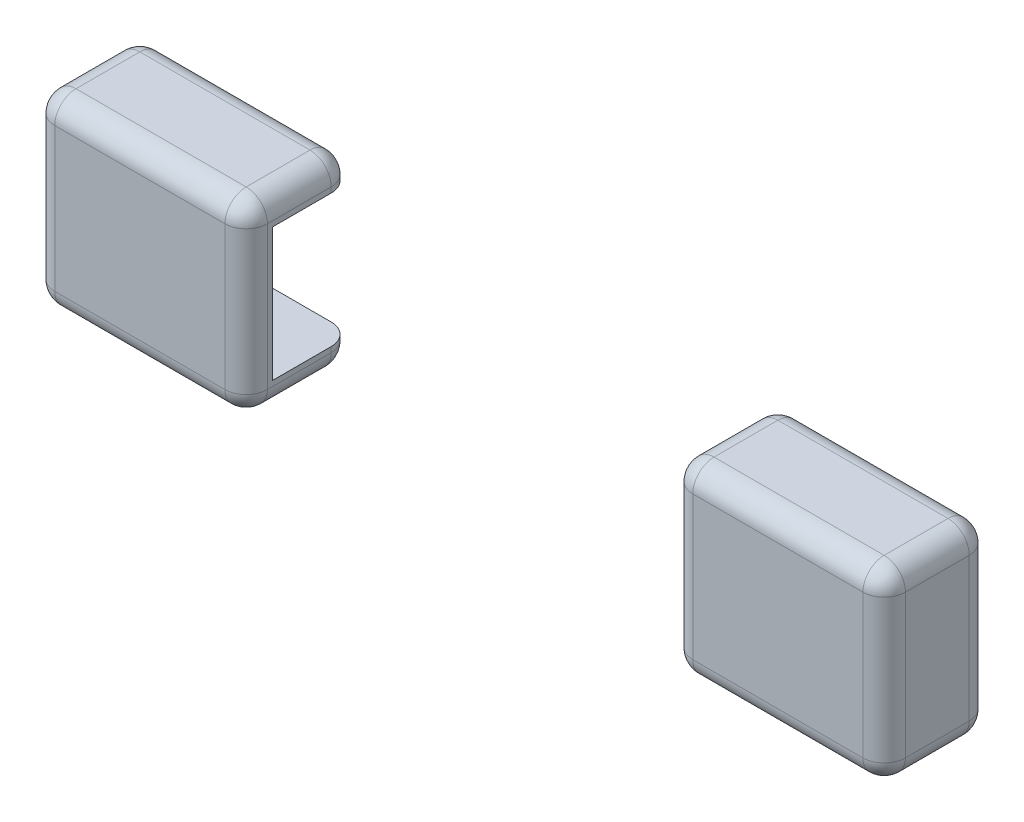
from build123d import *

# Parameters (mm, degrees)
LINEAR_AUSTRAGEN1_DEPTH         = 2.5
LINEAR_AUSTRAGEN1_DEPTH_BACK    = 7.5
SKIZZE3_W                       = 80
SKIZZE3_H                       = 17.5
LINEAR_AUSTRAGEN2_DEPTH         = 10
SCHNITT_LINEAR_AUSTRAGEN1_DEPTH = 44.084219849
SKIZZE10_W                      = 80
SKIZZE10_H                      = 17.5
LINEAR_AUSTRAGEN3_DEPTH         = 2.5
SKIZZE11_W                      = 40
SKIZZE11_H                      = 34.85908317
SCHNITT_LINEAR_AUSTRAGEN2_DEPTH = 44.084219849
VERRUNDUNG4_R                   = 2
VERRUNDUNG6_R                   = 2


with BuildPart() as part:
    # Skizze2 → Linear austragen1 (new, two sides: drawn at the far end of the back side and taken through both)
    with BuildSketch(Plane.XY.offset(-LINEAR_AUSTRAGEN1_DEPTH_BACK)):
        with BuildLine():
            Line((37.25, 6), (37.5, 6))
            Line((37.5, 6), (37.5, 8))
            ThreePointArc((37.5, 8), (36.914213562, 9.414213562), (35.5, 10))
            Line((35.5, 10), (-35.5, 10))
            ThreePointArc((-35.5, 10), (-36.914213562, 9.414213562), (-37.5, 8))
            Line((-37.5, 8), (-37.5, 6))
            Line((-37.5, 6), (-37.25, 6))
            Line((-37.25, 6), (-37.25, 1.5))
            Line((-37.25, 1.5), (-37.5, 1.5))
            Line((-37.5, 1.5), (-37.5, -0.5))
            ThreePointArc((-37.5, -0.5), (-36.914213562, -1.914213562), (-35.5, -2.5))
            Line((-35.5, -2.5), (35.5, -2.5))
            ThreePointArc((35.5, -2.5), (36.914213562, -1.914213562), (37.5, -0.5))
            Line((37.5, -0.5), (37.5, 1.5))
            Line((37.5, 1.5), (37.25, 1.5))
            Line((37.25, 1.5), (37.25, 6))
        make_face()
    extrude(amount=LINEAR_AUSTRAGEN1_DEPTH + LINEAR_AUSTRAGEN1_DEPTH_BACK)

    # Skizze3 → Linear austragen2 (add)
    with BuildSketch(Plane(origin=(0, 0, -7.5), x_dir=(-1, 0, 0), z_dir=(0, 0, -1))):
        with Locations((0, 3.75)):
            Rectangle(SKIZZE3_W, SKIZZE3_H)
    extrude(amount=-LINEAR_AUSTRAGEN2_DEPTH)

    # Skizze4 → Schnitt-Linear austragen1 (cut, through all)
    with BuildSketch(Plane.XY.offset(2.5)):
        with BuildLine():
            Line((37.25, 1.5), (37.25, 6))
            Line((37.25, 6), (37.5, 6))
            Line((37.5, 6), (37.5, 8))
            ThreePointArc((37.5, 8), (36.914213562, 9.414213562), (35.5, 10))
            Line((35.5, 10), (-35.5, 10))
            ThreePointArc((-35.5, 10), (-36.914213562, 9.414213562), (-37.5, 8))
            Line((-37.5, 8), (-37.5, 6))
            Line((-37.5, 6), (-37.25, 6))
            Line((-37.25, 6), (-37.25, 1.5))
            Line((-37.25, 1.5), (-37.5, 1.5))
            Line((-37.5, 1.5), (-37.5, -0.5))
            ThreePointArc((-37.5, -0.5), (-36.914213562, -1.914213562), (-35.5, -2.5))
            Line((-35.5, -2.5), (35.5, -2.5))
            ThreePointArc((35.5, -2.5), (36.914213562, -1.914213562), (37.5, -0.5))
            Line((37.5, -0.5), (37.5, 1.5))
            Line((37.5, 1.5), (37.25, 1.5))
        make_face()
    extrude(amount=-SCHNITT_LINEAR_AUSTRAGEN1_DEPTH, mode=Mode.SUBTRACT)

    # Skizze10 → Linear austragen3 (add)
    with BuildSketch(Plane.XY.offset(2.5)):
        with Locations((0, 3.75)):
            Rectangle(SKIZZE10_W, SKIZZE10_H)
    extrude(amount=-LINEAR_AUSTRAGEN3_DEPTH)

    # Skizze11 → Schnitt-Linear austragen2 (cut, through all)
    with BuildSketch(Plane.XY.offset(2.5)):
        with Locations((0, 4.618061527)):
            Rectangle(SKIZZE11_W, SKIZZE11_H)
    extrude(amount=-SCHNITT_LINEAR_AUSTRAGEN2_DEPTH, mode=Mode.SUBTRACT)


with BuildPart() as schnitt_linear_austragen2_piece_1:
    # of the separate pieces the step leaves, piece 1, a body of its own (schnitt_linear_austragen2_pieces)
    add(part.part.solids().sort_by_distance((-40, 12.5, -7.5))[0])

    # Verrundung4
    verrundung4_edges = [schnitt_linear_austragen2_piece_1.edges().sort_by_distance(p)[0] for p in [
        (-30, 12.5, 2.5),
        (-30, -5, 2.5),
        (-40, -5, -2.5),
        (-30, 12.5, -7.5),
        (-20, 11.25, -7.5),
        (-20, -3.75, -7.5),
        (-30, -5, -7.5),
        (-40, 3.75, -7.5),
        (-40, 12.5, -2.5),
        (-40, 3.75, 2.5),
        (-20, 12.5, -2.5),
        (-20, 3.75, 2.5),
        (-20, -5, -2.5),
    ]]
    fillet(verrundung4_edges, radius=VERRUNDUNG4_R)


with BuildPart() as schnitt_linear_austragen2_piece_2:
    # of the separate pieces the step leaves, piece 2, a body of its own (schnitt_linear_austragen2_pieces)
    add(part.part.solids().sort_by_distance((20, 12.5, -7.5))[0])

    # Verrundung6
    verrundung6_edges = [schnitt_linear_austragen2_piece_2.edges().sort_by_distance(p)[0] for p in [
        (30, 12.5, 2.5),
        (30, 12.5, -7.5),
        (20, 12.5, -2.5),
        (20, -5, -2.5),
        (20, -3.75, -7.5),
        (20, 11.25, -7.5),
        (20, 3.75, 2.5),
        (40, 3.75, -7.5),
        (30, -5, -7.5),
        (40, 12.5, -2.5),
        (40, 3.75, 2.5),
        (40, -5, -2.5),
        (30, -5, 2.5),
    ]]
    fillet(verrundung6_edges, radius=VERRUNDUNG6_R)


solid = Compound([schnitt_linear_austragen2_piece_1.part, schnitt_linear_austragen2_piece_2.part])
